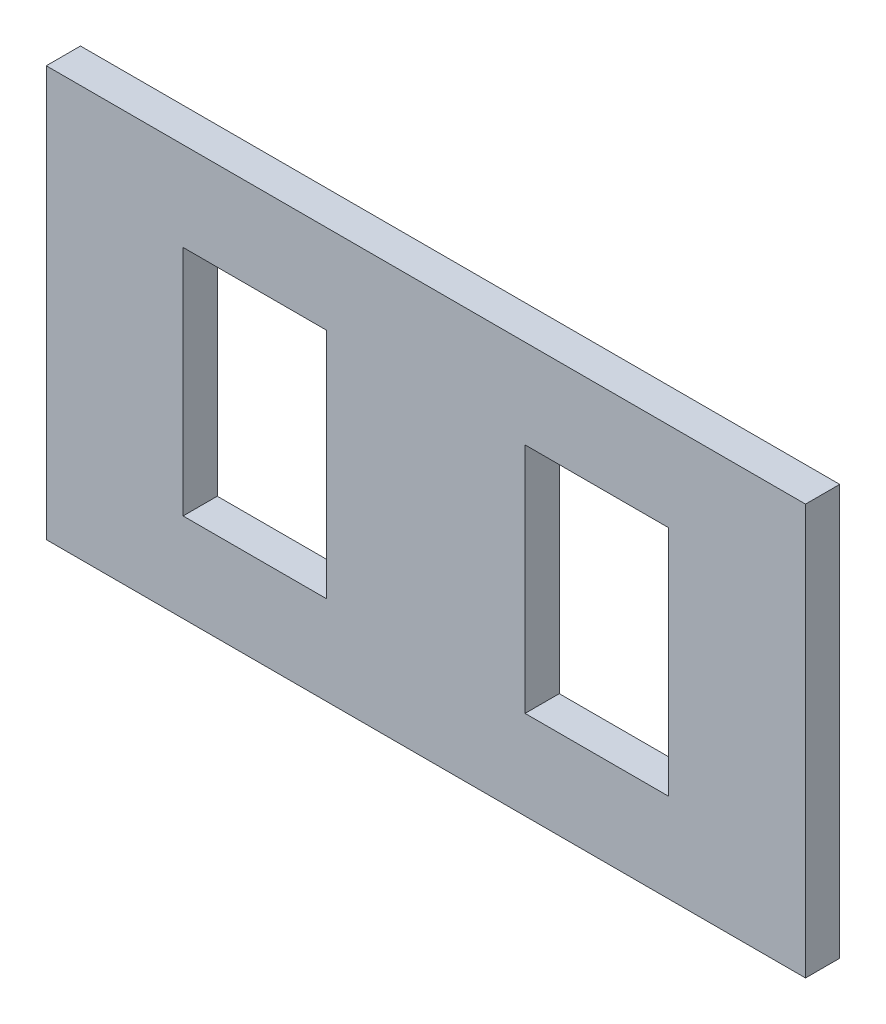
ISO-10303-21;
HEADER;
FILE_DESCRIPTION(('STEP AP214'),'2;1');
FILE_NAME('part.step','',(''),(''),'','','');
FILE_SCHEMA(('AUTOMOTIVE_DESIGN { 1 0 10303 214 1 1 1 1 }'));
ENDSEC;
DATA;
#1=APPLICATION_CONTEXT('core data for automotive mechanical design processes');
#2=APPLICATION_PROTOCOL_DEFINITION('international standard','automotive_design',2000,#1);
#3=PRODUCT_CONTEXT('',#1,'mechanical');
#4=PRODUCT('Part','Part','',(#3));
#5=PRODUCT_RELATED_PRODUCT_CATEGORY('part','',(#4));
#6=PRODUCT_DEFINITION_FORMATION('','',#4);
#7=PRODUCT_DEFINITION_CONTEXT('part definition',#1,'design');
#8=PRODUCT_DEFINITION('design','',#6,#7);
#9=PRODUCT_DEFINITION_SHAPE('','',#8);
#10=(LENGTH_UNIT() NAMED_UNIT(*) SI_UNIT(.MILLI.,.METRE.));
#11=(NAMED_UNIT(*) PLANE_ANGLE_UNIT() SI_UNIT($,.RADIAN.));
#12=(NAMED_UNIT(*) SI_UNIT($,.STERADIAN.) SOLID_ANGLE_UNIT());
#13=UNCERTAINTY_MEASURE_WITH_UNIT(LENGTH_MEASURE(1.E-05),#10,'distance_accuracy_value','');
#14=(GEOMETRIC_REPRESENTATION_CONTEXT(3) GLOBAL_UNCERTAINTY_ASSIGNED_CONTEXT((#13)) GLOBAL_UNIT_ASSIGNED_CONTEXT((#10,
#11,#12)) REPRESENTATION_CONTEXT('',''));
#15=CARTESIAN_POINT('',(0.,0.,0.));
#16=DIRECTION('',(0.,0.,1.));
#17=DIRECTION('',(1.,0.,0.));
#18=AXIS2_PLACEMENT_3D('',#15,#16,#17);
#19=CARTESIAN_POINT('',(0.,0.,5.));
#20=DIRECTION('',(0.,0.,1.));
#21=DIRECTION('',(1.,0.,0.));
#22=AXIS2_PLACEMENT_3D('',#19,#20,#21);
#23=PLANE('',#22);
#24=DIRECTION('',(0.,-1.,0.));
#25=VECTOR('',#24,1.);
#26=CARTESIAN_POINT('',(0.,60.,5.));
#27=LINE('',#26,#25);
#28=CARTESIAN_POINT('',(0.,60.,5.));
#29=VERTEX_POINT('',#28);
#30=CARTESIAN_POINT('',(0.,0.,5.));
#31=VERTEX_POINT('',#30);
#32=EDGE_CURVE('E220',#29,#31,#27,.T.);
#33=ORIENTED_EDGE('',*,*,#32,.T.);
#34=DIRECTION('',(1.,0.,0.));
#35=VECTOR('',#34,1.);
#36=CARTESIAN_POINT('',(0.,0.,5.));
#37=LINE('',#36,#35);
#38=CARTESIAN_POINT('',(111.,0.,5.));
#39=VERTEX_POINT('',#38);
#40=EDGE_CURVE('E224',#31,#39,#37,.T.);
#41=ORIENTED_EDGE('',*,*,#40,.T.);
#42=DIRECTION('',(0.,1.,0.));
#43=VECTOR('',#42,1.);
#44=CARTESIAN_POINT('',(111.,0.,5.));
#45=LINE('',#44,#43);
#46=CARTESIAN_POINT('',(111.,60.,5.));
#47=VERTEX_POINT('',#46);
#48=EDGE_CURVE('E228',#39,#47,#45,.T.);
#49=ORIENTED_EDGE('',*,*,#48,.T.);
#50=DIRECTION('',(-1.,0.,0.));
#51=VECTOR('',#50,1.);
#52=CARTESIAN_POINT('',(111.,60.,5.));
#53=LINE('',#52,#51);
#54=EDGE_CURVE('E231',#47,#29,#53,.T.);
#55=ORIENTED_EDGE('',*,*,#54,.T.);
#56=EDGE_LOOP('',(#33,#41,#49,#55));
#57=FACE_BOUND('',#56,.T.);
#58=DIRECTION('',(0.,-1.,0.));
#59=VECTOR('',#58,1.);
#60=CARTESIAN_POINT('',(20.,47.,5.));
#61=LINE('',#60,#59);
#62=CARTESIAN_POINT('',(20.,47.,5.));
#63=VERTEX_POINT('',#62);
#64=CARTESIAN_POINT('',(20.,13.,5.));
#65=VERTEX_POINT('',#64);
#66=EDGE_CURVE('E180',#63,#65,#61,.T.);
#67=ORIENTED_EDGE('',*,*,#66,.F.);
#68=DIRECTION('',(-1.,0.,0.));
#69=VECTOR('',#68,1.);
#70=CARTESIAN_POINT('',(41.,47.,5.));
#71=LINE('',#70,#69);
#72=CARTESIAN_POINT('',(41.,47.,5.));
#73=VERTEX_POINT('',#72);
#74=EDGE_CURVE('E177',#73,#63,#71,.T.);
#75=ORIENTED_EDGE('',*,*,#74,.F.);
#76=DIRECTION('',(0.,1.,0.));
#77=VECTOR('',#76,1.);
#78=CARTESIAN_POINT('',(41.,13.,5.));
#79=LINE('',#78,#77);
#80=CARTESIAN_POINT('',(41.,13.,5.));
#81=VERTEX_POINT('',#80);
#82=EDGE_CURVE('E188',#81,#73,#79,.T.);
#83=ORIENTED_EDGE('',*,*,#82,.F.);
#84=DIRECTION('',(1.,0.,0.));
#85=VECTOR('',#84,1.);
#86=CARTESIAN_POINT('',(20.,13.,5.));
#87=LINE('',#86,#85);
#88=EDGE_CURVE('E184',#65,#81,#87,.T.);
#89=ORIENTED_EDGE('',*,*,#88,.F.);
#90=EDGE_LOOP('',(#67,#75,#83,#89));
#91=FACE_BOUND('',#90,.T.);
#92=DIRECTION('',(1.,0.,0.));
#93=VECTOR('',#92,1.);
#94=CARTESIAN_POINT('',(70.,13.,5.));
#95=LINE('',#94,#93);
#96=CARTESIAN_POINT('',(70.,13.,5.));
#97=VERTEX_POINT('',#96);
#98=CARTESIAN_POINT('',(91.,13.,5.));
#99=VERTEX_POINT('',#98);
#100=EDGE_CURVE('E138',#97,#99,#95,.T.);
#101=ORIENTED_EDGE('',*,*,#100,.F.);
#102=DIRECTION('',(0.,-1.,0.));
#103=VECTOR('',#102,1.);
#104=CARTESIAN_POINT('',(70.,47.,5.));
#105=LINE('',#104,#103);
#106=CARTESIAN_POINT('',(70.,47.,5.));
#107=VERTEX_POINT('',#106);
#108=EDGE_CURVE('E129',#107,#97,#105,.T.);
#109=ORIENTED_EDGE('',*,*,#108,.F.);
#110=DIRECTION('',(-1.,0.,0.));
#111=VECTOR('',#110,1.);
#112=CARTESIAN_POINT('',(91.,47.,5.));
#113=LINE('',#112,#111);
#114=CARTESIAN_POINT('',(91.,47.,5.));
#115=VERTEX_POINT('',#114);
#116=EDGE_CURVE('E155',#115,#107,#113,.T.);
#117=ORIENTED_EDGE('',*,*,#116,.F.);
#118=DIRECTION('',(0.,1.,0.));
#119=VECTOR('',#118,1.);
#120=CARTESIAN_POINT('',(91.,13.,5.));
#121=LINE('',#120,#119);
#122=EDGE_CURVE('E151',#99,#115,#121,.T.);
#123=ORIENTED_EDGE('',*,*,#122,.F.);
#124=EDGE_LOOP('',(#101,#109,#117,#123));
#125=FACE_BOUND('',#124,.T.);
#126=ADVANCED_FACE('F39',(#57,#91,#125),#23,.T.);
#127=CARTESIAN_POINT('',(0.,0.,0.));
#128=DIRECTION('',(0.,0.,1.));
#129=DIRECTION('',(1.,0.,0.));
#130=AXIS2_PLACEMENT_3D('',#127,#128,#129);
#131=PLANE('',#130);
#132=DIRECTION('',(-1.,0.,0.));
#133=VECTOR('',#132,1.);
#134=CARTESIAN_POINT('',(41.,47.,0.));
#135=LINE('',#134,#133);
#136=CARTESIAN_POINT('',(41.,47.,0.));
#137=VERTEX_POINT('',#136);
#138=CARTESIAN_POINT('',(20.,47.,0.));
#139=VERTEX_POINT('',#138);
#140=EDGE_CURVE('E147',#137,#139,#135,.T.);
#141=ORIENTED_EDGE('',*,*,#140,.T.);
#142=DIRECTION('',(0.,-1.,0.));
#143=VECTOR('',#142,1.);
#144=CARTESIAN_POINT('',(20.,47.,0.));
#145=LINE('',#144,#143);
#146=CARTESIAN_POINT('',(20.,13.,0.));
#147=VERTEX_POINT('',#146);
#148=EDGE_CURVE('E195',#139,#147,#145,.T.);
#149=ORIENTED_EDGE('',*,*,#148,.T.);
#150=DIRECTION('',(1.,0.,0.));
#151=VECTOR('',#150,1.);
#152=CARTESIAN_POINT('',(20.,13.,0.));
#153=LINE('',#152,#151);
#154=CARTESIAN_POINT('',(41.,13.,0.));
#155=VERTEX_POINT('',#154);
#156=EDGE_CURVE('E199',#147,#155,#153,.T.);
#157=ORIENTED_EDGE('',*,*,#156,.T.);
#158=DIRECTION('',(0.,1.,0.));
#159=VECTOR('',#158,1.);
#160=CARTESIAN_POINT('',(41.,13.,0.));
#161=LINE('',#160,#159);
#162=EDGE_CURVE('E181',#155,#137,#161,.T.);
#163=ORIENTED_EDGE('',*,*,#162,.T.);
#164=EDGE_LOOP('',(#141,#149,#157,#163));
#165=FACE_BOUND('',#164,.T.);
#166=DIRECTION('',(0.,-1.,0.));
#167=VECTOR('',#166,1.);
#168=CARTESIAN_POINT('',(0.,60.,0.));
#169=LINE('',#168,#167);
#170=CARTESIAN_POINT('',(0.,60.,0.));
#171=VERTEX_POINT('',#170);
#172=CARTESIAN_POINT('',(0.,0.,0.));
#173=VERTEX_POINT('',#172);
#174=EDGE_CURVE('E219',#171,#173,#169,.T.);
#175=ORIENTED_EDGE('',*,*,#174,.F.);
#176=DIRECTION('',(-1.,0.,0.));
#177=VECTOR('',#176,1.);
#178=CARTESIAN_POINT('',(111.,60.,0.));
#179=LINE('',#178,#177);
#180=CARTESIAN_POINT('',(111.,60.,0.));
#181=VERTEX_POINT('',#180);
#182=EDGE_CURVE('E225',#181,#171,#179,.T.);
#183=ORIENTED_EDGE('',*,*,#182,.F.);
#184=DIRECTION('',(0.,1.,0.));
#185=VECTOR('',#184,1.);
#186=CARTESIAN_POINT('',(111.,0.,0.));
#187=LINE('',#186,#185);
#188=CARTESIAN_POINT('',(111.,0.,0.));
#189=VERTEX_POINT('',#188);
#190=EDGE_CURVE('E241',#189,#181,#187,.T.);
#191=ORIENTED_EDGE('',*,*,#190,.F.);
#192=DIRECTION('',(1.,0.,0.));
#193=VECTOR('',#192,1.);
#194=CARTESIAN_POINT('',(0.,0.,0.));
#195=LINE('',#194,#193);
#196=EDGE_CURVE('E238',#173,#189,#195,.T.);
#197=ORIENTED_EDGE('',*,*,#196,.F.);
#198=EDGE_LOOP('',(#175,#183,#191,#197));
#199=FACE_BOUND('',#198,.T.);
#200=DIRECTION('',(0.,-1.,0.));
#201=VECTOR('',#200,1.);
#202=CARTESIAN_POINT('',(70.,47.,0.));
#203=LINE('',#202,#201);
#204=CARTESIAN_POINT('',(70.,47.,0.));
#205=VERTEX_POINT('',#204);
#206=CARTESIAN_POINT('',(70.,13.,0.));
#207=VERTEX_POINT('',#206);
#208=EDGE_CURVE('E63',#205,#207,#203,.T.);
#209=ORIENTED_EDGE('',*,*,#208,.T.);
#210=DIRECTION('',(1.,0.,0.));
#211=VECTOR('',#210,1.);
#212=CARTESIAN_POINT('',(70.,13.,0.));
#213=LINE('',#212,#211);
#214=CARTESIAN_POINT('',(91.,13.,0.));
#215=VERTEX_POINT('',#214);
#216=EDGE_CURVE('E145',#207,#215,#213,.T.);
#217=ORIENTED_EDGE('',*,*,#216,.T.);
#218=DIRECTION('',(0.,1.,0.));
#219=VECTOR('',#218,1.);
#220=CARTESIAN_POINT('',(91.,13.,0.));
#221=LINE('',#220,#219);
#222=CARTESIAN_POINT('',(91.,47.,0.));
#223=VERTEX_POINT('',#222);
#224=EDGE_CURVE('E164',#215,#223,#221,.T.);
#225=ORIENTED_EDGE('',*,*,#224,.T.);
#226=DIRECTION('',(-1.,0.,0.));
#227=VECTOR('',#226,1.);
#228=CARTESIAN_POINT('',(91.,47.,0.));
#229=LINE('',#228,#227);
#230=EDGE_CURVE('E139',#223,#205,#229,.T.);
#231=ORIENTED_EDGE('',*,*,#230,.T.);
#232=EDGE_LOOP('',(#209,#217,#225,#231));
#233=FACE_BOUND('',#232,.T.);
#234=ADVANCED_FACE('F264',(#165,#199,#233),#131,.F.);
#235=CARTESIAN_POINT('',(0.,60.,5.));
#236=DIRECTION('',(1.,0.,0.));
#237=DIRECTION('',(0.,0.,-1.));
#238=AXIS2_PLACEMENT_3D('',#235,#236,#237);
#239=PLANE('',#238);
#240=ORIENTED_EDGE('',*,*,#174,.T.);
#241=DIRECTION('',(0.,0.,-1.));
#242=VECTOR('',#241,1.);
#243=CARTESIAN_POINT('',(0.,0.,5.));
#244=LINE('',#243,#242);
#245=EDGE_CURVE('E11',#31,#173,#244,.T.);
#246=ORIENTED_EDGE('',*,*,#245,.F.);
#247=ORIENTED_EDGE('',*,*,#32,.F.);
#248=DIRECTION('',(0.,0.,-1.));
#249=VECTOR('',#248,1.);
#250=CARTESIAN_POINT('',(0.,60.,5.));
#251=LINE('',#250,#249);
#252=EDGE_CURVE('E234',#29,#171,#251,.T.);
#253=ORIENTED_EDGE('',*,*,#252,.T.);
#254=EDGE_LOOP('',(#240,#246,#247,#253));
#255=FACE_BOUND('',#254,.T.);
#256=ADVANCED_FACE('F41',(#255),#239,.F.);
#257=CARTESIAN_POINT('',(0.,0.,5.));
#258=DIRECTION('',(0.,1.,0.));
#259=DIRECTION('',(0.,0.,1.));
#260=AXIS2_PLACEMENT_3D('',#257,#258,#259);
#261=PLANE('',#260);
#262=ORIENTED_EDGE('',*,*,#196,.T.);
#263=DIRECTION('',(0.,0.,-1.));
#264=VECTOR('',#263,1.);
#265=CARTESIAN_POINT('',(111.,0.,5.));
#266=LINE('',#265,#264);
#267=EDGE_CURVE('E48',#39,#189,#266,.T.);
#268=ORIENTED_EDGE('',*,*,#267,.F.);
#269=ORIENTED_EDGE('',*,*,#40,.F.);
#270=ORIENTED_EDGE('',*,*,#245,.T.);
#271=EDGE_LOOP('',(#262,#268,#269,#270));
#272=FACE_BOUND('',#271,.T.);
#273=ADVANCED_FACE('F275',(#272),#261,.F.);
#274=CARTESIAN_POINT('',(111.,0.,5.));
#275=DIRECTION('',(-1.,0.,0.));
#276=DIRECTION('',(0.,0.,1.));
#277=AXIS2_PLACEMENT_3D('',#274,#275,#276);
#278=PLANE('',#277);
#279=ORIENTED_EDGE('',*,*,#190,.T.);
#280=DIRECTION('',(0.,0.,-1.));
#281=VECTOR('',#280,1.);
#282=CARTESIAN_POINT('',(111.,60.,5.));
#283=LINE('',#282,#281);
#284=EDGE_CURVE('E249',#47,#181,#283,.T.);
#285=ORIENTED_EDGE('',*,*,#284,.F.);
#286=ORIENTED_EDGE('',*,*,#48,.F.);
#287=ORIENTED_EDGE('',*,*,#267,.T.);
#288=EDGE_LOOP('',(#279,#285,#286,#287));
#289=FACE_BOUND('',#288,.T.);
#290=ADVANCED_FACE('F258',(#289),#278,.F.);
#291=CARTESIAN_POINT('',(111.,60.,5.));
#292=DIRECTION('',(0.,-1.,0.));
#293=DIRECTION('',(1.,0.,0.));
#294=AXIS2_PLACEMENT_3D('',#291,#292,#293);
#295=PLANE('',#294);
#296=ORIENTED_EDGE('',*,*,#182,.T.);
#297=ORIENTED_EDGE('',*,*,#252,.F.);
#298=ORIENTED_EDGE('',*,*,#54,.F.);
#299=ORIENTED_EDGE('',*,*,#284,.T.);
#300=EDGE_LOOP('',(#296,#297,#298,#299));
#301=FACE_BOUND('',#300,.T.);
#302=ADVANCED_FACE('F268',(#301),#295,.F.);
#303=CARTESIAN_POINT('',(41.,47.,5.));
#304=DIRECTION('',(0.,-1.,0.));
#305=DIRECTION('',(0.,0.,-1.));
#306=AXIS2_PLACEMENT_3D('',#303,#304,#305);
#307=PLANE('',#306);
#308=ORIENTED_EDGE('',*,*,#140,.F.);
#309=DIRECTION('',(0.,0.,-1.));
#310=VECTOR('',#309,1.);
#311=CARTESIAN_POINT('',(41.,47.,5.));
#312=LINE('',#311,#310);
#313=EDGE_CURVE('E191',#73,#137,#312,.T.);
#314=ORIENTED_EDGE('',*,*,#313,.F.);
#315=ORIENTED_EDGE('',*,*,#74,.T.);
#316=DIRECTION('',(0.,0.,-1.));
#317=VECTOR('',#316,1.);
#318=CARTESIAN_POINT('',(20.,47.,5.));
#319=LINE('',#318,#317);
#320=EDGE_CURVE('E215',#63,#139,#319,.T.);
#321=ORIENTED_EDGE('',*,*,#320,.T.);
#322=EDGE_LOOP('',(#308,#314,#315,#321));
#323=FACE_BOUND('',#322,.T.);
#324=ADVANCED_FACE('F290',(#323),#307,.T.);
#325=CARTESIAN_POINT('',(20.,47.,5.));
#326=DIRECTION('',(1.,0.,0.));
#327=DIRECTION('',(0.,1.,0.));
#328=AXIS2_PLACEMENT_3D('',#325,#326,#327);
#329=PLANE('',#328);
#330=ORIENTED_EDGE('',*,*,#148,.F.);
#331=ORIENTED_EDGE('',*,*,#320,.F.);
#332=ORIENTED_EDGE('',*,*,#66,.T.);
#333=DIRECTION('',(0.,0.,-1.));
#334=VECTOR('',#333,1.);
#335=CARTESIAN_POINT('',(20.,13.,5.));
#336=LINE('',#335,#334);
#337=EDGE_CURVE('E212',#65,#147,#336,.T.);
#338=ORIENTED_EDGE('',*,*,#337,.T.);
#339=EDGE_LOOP('',(#330,#331,#332,#338));
#340=FACE_BOUND('',#339,.T.);
#341=ADVANCED_FACE('F297',(#340),#329,.T.);
#342=CARTESIAN_POINT('',(20.,13.,5.));
#343=DIRECTION('',(0.,1.,0.));
#344=DIRECTION('',(-1.,0.,0.));
#345=AXIS2_PLACEMENT_3D('',#342,#343,#344);
#346=PLANE('',#345);
#347=ORIENTED_EDGE('',*,*,#156,.F.);
#348=ORIENTED_EDGE('',*,*,#337,.F.);
#349=ORIENTED_EDGE('',*,*,#88,.T.);
#350=DIRECTION('',(0.,0.,-1.));
#351=VECTOR('',#350,1.);
#352=CARTESIAN_POINT('',(41.,13.,5.));
#353=LINE('',#352,#351);
#354=EDGE_CURVE('E209',#81,#155,#353,.T.);
#355=ORIENTED_EDGE('',*,*,#354,.T.);
#356=EDGE_LOOP('',(#347,#348,#349,#355));
#357=FACE_BOUND('',#356,.T.);
#358=ADVANCED_FACE('F302',(#357),#346,.T.);
#359=CARTESIAN_POINT('',(41.,13.,5.));
#360=DIRECTION('',(-1.,0.,0.));
#361=DIRECTION('',(0.,0.,1.));
#362=AXIS2_PLACEMENT_3D('',#359,#360,#361);
#363=PLANE('',#362);
#364=ORIENTED_EDGE('',*,*,#162,.F.);
#365=ORIENTED_EDGE('',*,*,#354,.F.);
#366=ORIENTED_EDGE('',*,*,#82,.T.);
#367=ORIENTED_EDGE('',*,*,#313,.T.);
#368=EDGE_LOOP('',(#364,#365,#366,#367));
#369=FACE_BOUND('',#368,.T.);
#370=ADVANCED_FACE('F309',(#369),#363,.T.);
#371=CARTESIAN_POINT('',(70.,47.,5.));
#372=DIRECTION('',(1.,0.,0.));
#373=DIRECTION('',(0.,1.,0.));
#374=AXIS2_PLACEMENT_3D('',#371,#372,#373);
#375=PLANE('',#374);
#376=ORIENTED_EDGE('',*,*,#208,.F.);
#377=DIRECTION('',(0.,0.,-1.));
#378=VECTOR('',#377,1.);
#379=CARTESIAN_POINT('',(70.,47.,5.));
#380=LINE('',#379,#378);
#381=EDGE_CURVE('E133',#107,#205,#380,.T.);
#382=ORIENTED_EDGE('',*,*,#381,.F.);
#383=ORIENTED_EDGE('',*,*,#108,.T.);
#384=DIRECTION('',(0.,0.,-1.));
#385=VECTOR('',#384,1.);
#386=CARTESIAN_POINT('',(70.,13.,5.));
#387=LINE('',#386,#385);
#388=EDGE_CURVE('E132',#97,#207,#387,.T.);
#389=ORIENTED_EDGE('',*,*,#388,.T.);
#390=EDGE_LOOP('',(#376,#382,#383,#389));
#391=FACE_BOUND('',#390,.T.);
#392=ADVANCED_FACE('F131',(#391),#375,.T.);
#393=CARTESIAN_POINT('',(70.,13.,5.));
#394=DIRECTION('',(0.,1.,0.));
#395=DIRECTION('',(-1.,0.,0.));
#396=AXIS2_PLACEMENT_3D('',#393,#394,#395);
#397=PLANE('',#396);
#398=ORIENTED_EDGE('',*,*,#216,.F.);
#399=ORIENTED_EDGE('',*,*,#388,.F.);
#400=ORIENTED_EDGE('',*,*,#100,.T.);
#401=DIRECTION('',(0.,0.,-1.));
#402=VECTOR('',#401,1.);
#403=CARTESIAN_POINT('',(91.,13.,5.));
#404=LINE('',#403,#402);
#405=EDGE_CURVE('E148',#99,#215,#404,.T.);
#406=ORIENTED_EDGE('',*,*,#405,.T.);
#407=EDGE_LOOP('',(#398,#399,#400,#406));
#408=FACE_BOUND('',#407,.T.);
#409=ADVANCED_FACE('F142',(#408),#397,.T.);
#410=CARTESIAN_POINT('',(91.,13.,5.));
#411=DIRECTION('',(-1.,0.,0.));
#412=DIRECTION('',(0.,-1.,0.));
#413=AXIS2_PLACEMENT_3D('',#410,#411,#412);
#414=PLANE('',#413);
#415=ORIENTED_EDGE('',*,*,#224,.F.);
#416=ORIENTED_EDGE('',*,*,#405,.F.);
#417=ORIENTED_EDGE('',*,*,#122,.T.);
#418=DIRECTION('',(0.,0.,-1.));
#419=VECTOR('',#418,1.);
#420=CARTESIAN_POINT('',(91.,47.,5.));
#421=LINE('',#420,#419);
#422=EDGE_CURVE('E55',#115,#223,#421,.T.);
#423=ORIENTED_EDGE('',*,*,#422,.T.);
#424=EDGE_LOOP('',(#415,#416,#417,#423));
#425=FACE_BOUND('',#424,.T.);
#426=ADVANCED_FACE('F327',(#425),#414,.T.);
#427=CARTESIAN_POINT('',(91.,47.,5.));
#428=DIRECTION('',(0.,-1.,0.));
#429=DIRECTION('',(0.,0.,-1.));
#430=AXIS2_PLACEMENT_3D('',#427,#428,#429);
#431=PLANE('',#430);
#432=ORIENTED_EDGE('',*,*,#230,.F.);
#433=ORIENTED_EDGE('',*,*,#422,.F.);
#434=ORIENTED_EDGE('',*,*,#116,.T.);
#435=ORIENTED_EDGE('',*,*,#381,.T.);
#436=EDGE_LOOP('',(#432,#433,#434,#435));
#437=FACE_BOUND('',#436,.T.);
#438=ADVANCED_FACE('F330',(#437),#431,.T.);
#439=CLOSED_SHELL('',(#126,#234,#256,#273,#290,#302,#324,#341,#358,#370,#392,#409,#426,#438));
#440=MANIFOLD_SOLID_BREP('B2',#439);
#441=ADVANCED_BREP_SHAPE_REPRESENTATION('',(#18,#440),#14);
#442=SHAPE_DEFINITION_REPRESENTATION(#9,#441);
ENDSEC;
END-ISO-10303-21;
